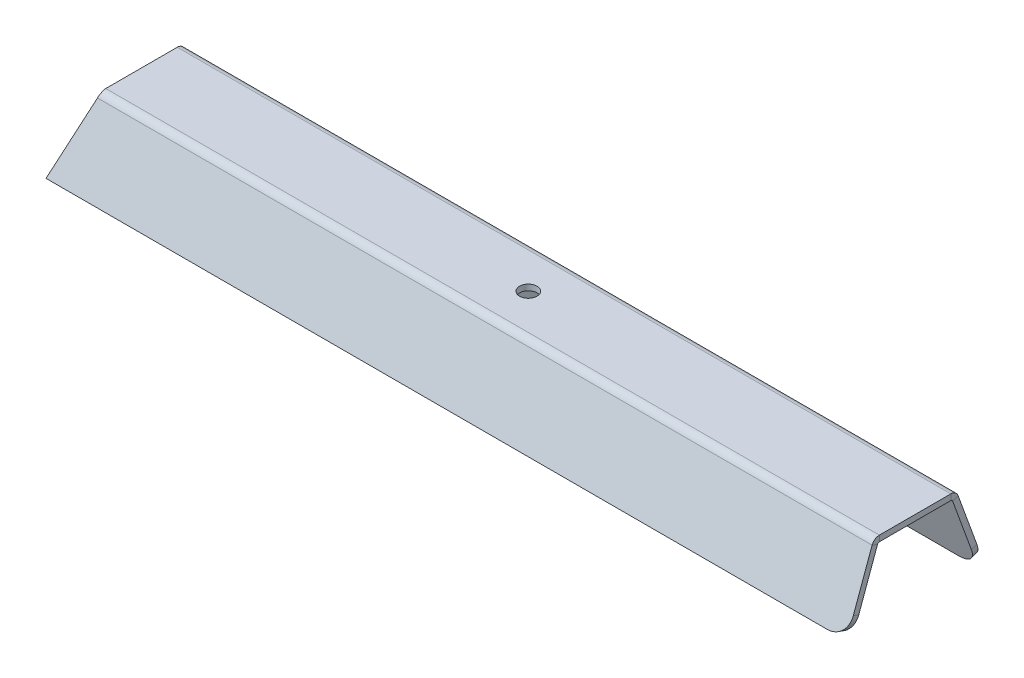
ISO-10303-21;
HEADER;
FILE_DESCRIPTION(('STEP AP214'),'2;1');
FILE_NAME('part.step','',(''),(''),'','','');
FILE_SCHEMA(('AUTOMOTIVE_DESIGN { 1 0 10303 214 1 1 1 1 }'));
ENDSEC;
DATA;
#1=APPLICATION_CONTEXT('core data for automotive mechanical design processes');
#2=APPLICATION_PROTOCOL_DEFINITION('international standard','automotive_design',2000,#1);
#3=PRODUCT_CONTEXT('',#1,'mechanical');
#4=PRODUCT('Part','Part','',(#3));
#5=PRODUCT_RELATED_PRODUCT_CATEGORY('part','',(#4));
#6=PRODUCT_DEFINITION_FORMATION('','',#4);
#7=PRODUCT_DEFINITION_CONTEXT('part definition',#1,'design');
#8=PRODUCT_DEFINITION('design','',#6,#7);
#9=PRODUCT_DEFINITION_SHAPE('','',#8);
#10=(LENGTH_UNIT() NAMED_UNIT(*) SI_UNIT(.MILLI.,.METRE.));
#11=(NAMED_UNIT(*) PLANE_ANGLE_UNIT() SI_UNIT($,.RADIAN.));
#12=(NAMED_UNIT(*) SI_UNIT($,.STERADIAN.) SOLID_ANGLE_UNIT());
#13=UNCERTAINTY_MEASURE_WITH_UNIT(LENGTH_MEASURE(1.E-05),#10,'distance_accuracy_value','');
#14=(GEOMETRIC_REPRESENTATION_CONTEXT(3) GLOBAL_UNCERTAINTY_ASSIGNED_CONTEXT((#13)) GLOBAL_UNIT_ASSIGNED_CONTEXT((#10,
#11,#12)) REPRESENTATION_CONTEXT('',''));
#15=CARTESIAN_POINT('',(0.,0.,0.));
#16=DIRECTION('',(0.,0.,1.));
#17=DIRECTION('',(1.,0.,0.));
#18=AXIS2_PLACEMENT_3D('',#15,#16,#17);
#19=CARTESIAN_POINT('',(95.,-1.5,-25.));
#20=DIRECTION('',(0.,1.,0.));
#21=DIRECTION('',(0.,0.,1.));
#22=AXIS2_PLACEMENT_3D('',#19,#20,#21);
#23=PLANE('',#22);
#24=CARTESIAN_POINT('',(0.,-1.5,0.));
#25=DIRECTION('',(0.,1.,0.));
#26=DIRECTION('',(0.,0.,1.));
#27=AXIS2_PLACEMENT_3D('',#24,#25,#26);
#28=CIRCLE('',#27,2.25);
#29=CARTESIAN_POINT('',(0.,-1.5,2.25));
#30=VERTEX_POINT('',#29);
#31=EDGE_CURVE('E499',#30,#30,#28,.T.);
#32=ORIENTED_EDGE('',*,*,#31,.T.);
#33=EDGE_LOOP('',(#32));
#34=FACE_BOUND('',#33,.T.);
#35=DIRECTION('',(0.,0.,-1.));
#36=VECTOR('',#35,1.);
#37=CARTESIAN_POINT('',(100.,-1.5,-24.9999999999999));
#38=LINE('',#37,#36);
#39=CARTESIAN_POINT('',(100.,-1.5,9.23641845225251));
#40=VERTEX_POINT('',#39);
#41=CARTESIAN_POINT('',(100.,-1.5,-9.23641845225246));
#42=VERTEX_POINT('',#41);
#43=EDGE_CURVE('E472',#40,#42,#38,.T.);
#44=ORIENTED_EDGE('',*,*,#43,.F.);
#45=DIRECTION('',(-1.,0.,0.));
#46=VECTOR('',#45,1.);
#47=CARTESIAN_POINT('',(95.,-1.5,9.23641845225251));
#48=LINE('',#47,#46);
#49=CARTESIAN_POINT('',(-100.,-1.5,9.23641845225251));
#50=VERTEX_POINT('',#49);
#51=EDGE_CURVE('E476',#40,#50,#48,.T.);
#52=ORIENTED_EDGE('',*,*,#51,.T.);
#53=DIRECTION('',(0.,0.,1.));
#54=VECTOR('',#53,1.);
#55=CARTESIAN_POINT('',(-100.,-1.5,10.));
#56=LINE('',#55,#54);
#57=CARTESIAN_POINT('',(-100.,-1.5,-9.23641845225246));
#58=VERTEX_POINT('',#57);
#59=EDGE_CURVE('E496',#58,#50,#56,.T.);
#60=ORIENTED_EDGE('',*,*,#59,.F.);
#61=DIRECTION('',(-1.,0.,0.));
#62=VECTOR('',#61,1.);
#63=CARTESIAN_POINT('',(95.,-1.5,-9.23641845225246));
#64=LINE('',#63,#62);
#65=EDGE_CURVE('E501',#42,#58,#64,.T.);
#66=ORIENTED_EDGE('',*,*,#65,.F.);
#67=EDGE_LOOP('',(#44,#52,#60,#66));
#68=FACE_BOUND('',#67,.T.);
#69=ADVANCED_FACE('F58',(#34,#68),#23,.F.);
#70=CARTESIAN_POINT('',(-100.,-1.5,10.));
#71=DIRECTION('',(-1.,0.,0.));
#72=DIRECTION('',(0.,0.,1.));
#73=AXIS2_PLACEMENT_3D('',#70,#71,#72);
#74=PLANE('',#73);
#75=DIRECTION('',(0.,-1.,0.));
#76=VECTOR('',#75,1.);
#77=CARTESIAN_POINT('',(-100.,-1.5,9.2364184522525));
#78=LINE('',#77,#76);
#79=CARTESIAN_POINT('',(-100.,0.,9.23641845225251));
#80=VERTEX_POINT('',#79);
#81=EDGE_CURVE('E12',#80,#50,#78,.T.);
#82=ORIENTED_EDGE('',*,*,#81,.F.);
#83=DIRECTION('',(0.,0.,1.));
#84=VECTOR('',#83,1.);
#85=CARTESIAN_POINT('',(-100.,0.,10.));
#86=LINE('',#85,#84);
#87=CARTESIAN_POINT('',(-100.,0.,-9.23641845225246));
#88=VERTEX_POINT('',#87);
#89=EDGE_CURVE('E77',#88,#80,#86,.T.);
#90=ORIENTED_EDGE('',*,*,#89,.F.);
#91=DIRECTION('',(0.,-1.,0.));
#92=VECTOR('',#91,1.);
#93=CARTESIAN_POINT('',(-100.,-1.5,-9.23641845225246));
#94=LINE('',#93,#92);
#95=EDGE_CURVE('E536',#88,#58,#94,.T.);
#96=ORIENTED_EDGE('',*,*,#95,.T.);
#97=ORIENTED_EDGE('',*,*,#59,.T.);
#98=EDGE_LOOP('',(#82,#90,#96,#97));
#99=FACE_BOUND('',#98,.T.);
#100=ADVANCED_FACE('F457',(#99),#74,.T.);
#101=CARTESIAN_POINT('',(100.,-1.5,-24.9999999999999));
#102=DIRECTION('',(1.,0.,0.));
#103=DIRECTION('',(0.,0.,-1.));
#104=AXIS2_PLACEMENT_3D('',#101,#102,#103);
#105=PLANE('',#104);
#106=DIRECTION('',(0.,1.,0.));
#107=VECTOR('',#106,1.);
#108=CARTESIAN_POINT('',(100.,-1.5,9.23641845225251));
#109=LINE('',#108,#107);
#110=CARTESIAN_POINT('',(100.,0.,9.23641845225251));
#111=VERTEX_POINT('',#110);
#112=EDGE_CURVE('E470',#40,#111,#109,.T.);
#113=ORIENTED_EDGE('',*,*,#112,.F.);
#114=ORIENTED_EDGE('',*,*,#43,.T.);
#115=DIRECTION('',(0.,1.,0.));
#116=VECTOR('',#115,1.);
#117=CARTESIAN_POINT('',(100.,-1.5,-9.23641845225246));
#118=LINE('',#117,#116);
#119=CARTESIAN_POINT('',(100.,0.,-9.23641845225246));
#120=VERTEX_POINT('',#119);
#121=EDGE_CURVE('E486',#42,#120,#118,.T.);
#122=ORIENTED_EDGE('',*,*,#121,.T.);
#123=DIRECTION('',(0.,0.,-1.));
#124=VECTOR('',#123,1.);
#125=CARTESIAN_POINT('',(100.,0.,-24.9999999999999));
#126=LINE('',#125,#124);
#127=EDGE_CURVE('E85',#111,#120,#126,.T.);
#128=ORIENTED_EDGE('',*,*,#127,.F.);
#129=EDGE_LOOP('',(#113,#114,#122,#128));
#130=FACE_BOUND('',#129,.T.);
#131=ADVANCED_FACE('F460',(#130),#105,.T.);
#132=CARTESIAN_POINT('',(95.,0.,-25.));
#133=DIRECTION('',(0.,1.,0.));
#134=DIRECTION('',(0.,0.,1.));
#135=AXIS2_PLACEMENT_3D('',#132,#133,#134);
#136=PLANE('',#135);
#137=DIRECTION('',(-1.,0.,0.));
#138=VECTOR('',#137,1.);
#139=CARTESIAN_POINT('',(95.,0.,9.23641845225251));
#140=LINE('',#139,#138);
#141=EDGE_CURVE('E69',#111,#80,#140,.T.);
#142=ORIENTED_EDGE('',*,*,#141,.F.);
#143=ORIENTED_EDGE('',*,*,#127,.T.);
#144=DIRECTION('',(-1.,0.,0.));
#145=VECTOR('',#144,1.);
#146=CARTESIAN_POINT('',(95.,0.,-9.23641845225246));
#147=LINE('',#146,#145);
#148=EDGE_CURVE('E488',#120,#88,#147,.T.);
#149=ORIENTED_EDGE('',*,*,#148,.T.);
#150=ORIENTED_EDGE('',*,*,#89,.T.);
#151=EDGE_LOOP('',(#142,#143,#149,#150));
#152=FACE_BOUND('',#151,.T.);
#153=CARTESIAN_POINT('',(0.,0.,0.));
#154=DIRECTION('',(0.,1.,0.));
#155=DIRECTION('',(0.,0.,1.));
#156=AXIS2_PLACEMENT_3D('',#153,#154,#155);
#157=CIRCLE('',#156,2.25);
#158=CARTESIAN_POINT('',(0.,0.,2.25));
#159=VERTEX_POINT('',#158);
#160=EDGE_CURVE('E540',#159,#159,#157,.T.);
#161=ORIENTED_EDGE('',*,*,#160,.F.);
#162=EDGE_LOOP('',(#161));
#163=FACE_BOUND('',#162,.T.);
#164=ADVANCED_FACE('F60',(#152,#163),#136,.T.);
#165=CARTESIAN_POINT('',(0.,-1.5,0.));
#166=DIRECTION('',(0.,1.,0.));
#167=DIRECTION('',(0.,0.,1.));
#168=AXIS2_PLACEMENT_3D('',#165,#166,#167);
#169=CYLINDRICAL_SURFACE('',#168,2.25);
#170=ORIENTED_EDGE('',*,*,#31,.F.);
#171=EDGE_LOOP('',(#170));
#172=FACE_BOUND('',#171,.T.);
#173=ORIENTED_EDGE('',*,*,#160,.T.);
#174=EDGE_LOOP('',(#173));
#175=FACE_BOUND('',#174,.T.);
#176=ADVANCED_FACE('F452',(#172,#175),#169,.F.);
#177=CARTESIAN_POINT('',(100.,-2.,-9.23641845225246));
#178=DIRECTION('',(-1.,0.,0.));
#179=DIRECTION('',(0.,0.,1.));
#180=AXIS2_PLACEMENT_3D('',#177,#178,#179);
#181=PLANE('',#180);
#182=DIRECTION('',(0.,0.342020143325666,-0.93969262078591));
#183=VECTOR('',#182,1.);
#184=CARTESIAN_POINT('',(100.,-1.82898992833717,-9.70626476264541));
#185=LINE('',#184,#183);
#186=CARTESIAN_POINT('',(100.,-1.82898992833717,-9.70626476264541));
#187=VERTEX_POINT('',#186);
#188=CARTESIAN_POINT('',(100.,-1.31595971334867,-11.1158036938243));
#189=VERTEX_POINT('',#188);
#190=EDGE_CURVE('E351',#187,#189,#185,.T.);
#191=ORIENTED_EDGE('',*,*,#190,.T.);
#192=CARTESIAN_POINT('',(100.,-2.,-9.23641845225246));
#193=DIRECTION('',(1.,0.,0.));
#194=DIRECTION('',(0.,0.,-1.));
#195=AXIS2_PLACEMENT_3D('',#192,#193,#194);
#196=CIRCLE('',#195,2.);
#197=EDGE_CURVE('E326',#189,#120,#196,.T.);
#198=ORIENTED_EDGE('',*,*,#197,.T.);
#199=ORIENTED_EDGE('',*,*,#121,.F.);
#200=CARTESIAN_POINT('',(100.,-2.,-9.23641845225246));
#201=DIRECTION('',(1.,0.,0.));
#202=DIRECTION('',(0.,0.,1.));
#203=AXIS2_PLACEMENT_3D('',#200,#201,#202);
#204=CIRCLE('',#203,0.500000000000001);
#205=EDGE_CURVE('E355',#187,#42,#204,.T.);
#206=ORIENTED_EDGE('',*,*,#205,.F.);
#207=EDGE_LOOP('',(#191,#198,#199,#206));
#208=FACE_BOUND('',#207,.T.);
#209=ADVANCED_FACE('F449',(#208),#181,.F.);
#210=CARTESIAN_POINT('',(-100.,-2.,-9.23641845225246));
#211=DIRECTION('',(1.,0.,0.));
#212=DIRECTION('',(0.,0.,-1.));
#213=AXIS2_PLACEMENT_3D('',#210,#211,#212);
#214=PLANE('',#213);
#215=ORIENTED_EDGE('',*,*,#95,.F.);
#216=CARTESIAN_POINT('',(-100.,-2.,-9.23641845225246));
#217=DIRECTION('',(1.,0.,0.));
#218=DIRECTION('',(0.,0.,-1.));
#219=AXIS2_PLACEMENT_3D('',#216,#217,#218);
#220=CIRCLE('',#219,2.);
#221=CARTESIAN_POINT('',(-100.,-0.361695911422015,-10.3835713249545));
#222=VERTEX_POINT('',#221);
#223=EDGE_CURVE('E396',#88,#222,#220,.F.);
#224=ORIENTED_EDGE('',*,*,#223,.T.);
#225=CARTESIAN_POINT('',(-100.,-1.5904239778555,-9.52320667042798));
#226=CARTESIAN_POINT('',(-100.,-0.361695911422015,-10.3835713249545));
#227=B_SPLINE_CURVE_WITH_KNOTS('',1,(#225,#226),.UNSPECIFIED.,.F.,.F.,(2,2),(0.,1.),.UNSPECIFIED.);
#228=CARTESIAN_POINT('',(-100.,-1.5904239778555,-9.52320667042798));
#229=VERTEX_POINT('',#228);
#230=EDGE_CURVE('E434',#222,#229,#227,.F.);
#231=ORIENTED_EDGE('',*,*,#230,.T.);
#232=CARTESIAN_POINT('',(-100.,-2.,-9.23641845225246));
#233=DIRECTION('',(-1.,0.,0.));
#234=DIRECTION('',(0.,0.,-1.));
#235=AXIS2_PLACEMENT_3D('',#232,#233,#234);
#236=CIRCLE('',#235,0.5);
#237=EDGE_CURVE('E358',#58,#229,#236,.T.);
#238=ORIENTED_EDGE('',*,*,#237,.F.);
#239=EDGE_LOOP('',(#215,#224,#231,#238));
#240=FACE_BOUND('',#239,.T.);
#241=ADVANCED_FACE('F440',(#240),#214,.F.);
#242=CARTESIAN_POINT('',(-100.,-0.361695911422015,-10.3835713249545));
#243=CARTESIAN_POINT('',(-100.089318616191,-0.595895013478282,-10.718042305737));
#244=CARTESIAN_POINT('',(-100.17793492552,-0.932270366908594,-10.976152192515));
#245=CARTESIAN_POINT('',(-100.267253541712,-1.31595971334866,-11.1158036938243));
#246=CARTESIAN_POINT('',(-100.,-1.5904239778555,-9.52320667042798));
#247=CARTESIAN_POINT('',(-100.089245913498,-1.64892609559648,-9.60675635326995));
#248=CARTESIAN_POINT('',(-100.178007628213,-1.73314566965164,-9.67138030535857));
#249=CARTESIAN_POINT('',(-100.267253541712,-1.82898992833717,-9.70626476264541));
#250=B_SPLINE_SURFACE_WITH_KNOTS('',1,3,((#242,#243,#244,#245),(#246,#247,#248,#249)),
.UNSPECIFIED.,.F.,.F.,.F.,(2,2),(4,4),(0.,1.),(0.,1.),.UNSPECIFIED.);
#251=CARTESIAN_POINT('',(-100.,-0.361695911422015,-10.3835713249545));
#252=CARTESIAN_POINT('',(-100.089318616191,-0.595895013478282,-10.718042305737));
#253=CARTESIAN_POINT('',(-100.17793492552,-0.932270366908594,-10.976152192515));
#254=CARTESIAN_POINT('',(-100.267253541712,-1.31595971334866,-11.1158036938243));
#255=B_SPLINE_CURVE_WITH_KNOTS('',3,(#251,#252,#253,#254),.UNSPECIFIED.,.F.,.F.,(4,4),(0.,1.),.UNSPECIFIED.);
#256=CARTESIAN_POINT('',(-100.267253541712,-1.31595971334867,-11.1158036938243));
#257=VERTEX_POINT('',#256);
#258=EDGE_CURVE('E359',#222,#257,#255,.T.);
#259=CARTESIAN_POINT('',(-100.267253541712,-1.31595971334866,-11.1158036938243));
#260=CARTESIAN_POINT('',(-100.267253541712,-1.82898992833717,-9.70626476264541));
#261=B_SPLINE_CURVE_WITH_KNOTS('',1,(#259,#260),.UNSPECIFIED.,.F.,.F.,(2,2),(0.,1.),.UNSPECIFIED.);
#262=CARTESIAN_POINT('',(-100.267253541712,-1.82898992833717,-9.70626476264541));
#263=VERTEX_POINT('',#262);
#264=EDGE_CURVE('E350',#257,#263,#261,.T.);
#265=CARTESIAN_POINT('',(-100.267253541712,-1.82898992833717,-9.70626476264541));
#266=CARTESIAN_POINT('',(-100.178007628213,-1.73314566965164,-9.67138030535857));
#267=CARTESIAN_POINT('',(-100.089245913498,-1.64892609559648,-9.60675635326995));
#268=CARTESIAN_POINT('',(-100.,-1.5904239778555,-9.52320667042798));
#269=B_SPLINE_CURVE_WITH_KNOTS('',3,(#265,#266,#267,#268),.UNSPECIFIED.,.F.,.F.,(4,4),(0.,1.),.UNSPECIFIED.);
#270=EDGE_CURVE('E411',#229,#263,#269,.F.);
#271=ORIENTED_EDGE('',*,*,#230,.F.);
#272=ORIENTED_EDGE('',*,*,#258,.T.);
#273=ORIENTED_EDGE('',*,*,#264,.T.);
#274=ORIENTED_EDGE('',*,*,#270,.F.);
#275=EDGE_LOOP('',(#271,#272,#273,#274));
#276=FACE_BOUND('',#275,.T.);
#277=ADVANCED_FACE('F376',(#276),#250,.F.);
#278=CARTESIAN_POINT('',(-200.27869349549,-2.,-9.23641845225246));
#279=DIRECTION('',(1.,0.,0.));
#280=DIRECTION('',(0.,0.,-1.));
#281=AXIS2_PLACEMENT_3D('',#278,#279,#280);
#282=CYLINDRICAL_SURFACE('',#281,0.5);
#283=ORIENTED_EDGE('',*,*,#270,.T.);
#284=DIRECTION('',(-1.,0.,0.));
#285=VECTOR('',#284,1.);
#286=CARTESIAN_POINT('',(95.,-1.82898992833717,-9.70626476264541));
#287=LINE('',#286,#285);
#288=EDGE_CURVE('E341',#187,#263,#287,.T.);
#289=ORIENTED_EDGE('',*,*,#288,.F.);
#290=ORIENTED_EDGE('',*,*,#205,.T.);
#291=ORIENTED_EDGE('',*,*,#65,.T.);
#292=ORIENTED_EDGE('',*,*,#237,.T.);
#293=EDGE_LOOP('',(#283,#289,#290,#291,#292));
#294=FACE_BOUND('',#293,.T.);
#295=ADVANCED_FACE('F365',(#294),#282,.F.);
#296=CARTESIAN_POINT('',(-200.27869349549,-2.,-9.23641845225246));
#297=DIRECTION('',(1.,0.,0.));
#298=DIRECTION('',(0.,0.,-1.));
#299=AXIS2_PLACEMENT_3D('',#296,#297,#298);
#300=CYLINDRICAL_SURFACE('',#299,2.);
#301=ORIENTED_EDGE('',*,*,#258,.F.);
#302=ORIENTED_EDGE('',*,*,#223,.F.);
#303=ORIENTED_EDGE('',*,*,#148,.F.);
#304=ORIENTED_EDGE('',*,*,#197,.F.);
#305=DIRECTION('',(-1.,0.,0.));
#306=VECTOR('',#305,1.);
#307=CARTESIAN_POINT('',(95.,-1.31595971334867,-11.1158036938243));
#308=LINE('',#307,#306);
#309=EDGE_CURVE('E354',#189,#257,#308,.T.);
#310=ORIENTED_EDGE('',*,*,#309,.T.);
#311=EDGE_LOOP('',(#301,#302,#303,#304,#310));
#312=FACE_BOUND('',#311,.T.);
#313=ADVANCED_FACE('F375',(#312),#300,.T.);
#314=CARTESIAN_POINT('',(95.,-15.2068472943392,-14.575406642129));
#315=DIRECTION('',(0.,0.342020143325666,-0.93969262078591));
#316=DIRECTION('',(0.,0.93969262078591,0.342020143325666));
#317=AXIS2_PLACEMENT_3D('',#314,#315,#316);
#318=CYLINDRICAL_SURFACE('',#317,5.);
#319=CARTESIAN_POINT('',(95.,-14.6938170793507,-15.9849455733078));
#320=DIRECTION('',(0.,0.342020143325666,-0.93969262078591));
#321=DIRECTION('',(0.,0.93969262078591,0.342020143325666));
#322=AXIS2_PLACEMENT_3D('',#319,#320,#321);
#323=CIRCLE('',#322,5.);
#324=CARTESIAN_POINT('',(100.,-14.6938170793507,-15.9849455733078));
#325=VERTEX_POINT('',#324);
#326=CARTESIAN_POINT('',(95.,-19.3922801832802,-17.6950462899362));
#327=VERTEX_POINT('',#326);
#328=EDGE_CURVE('E333',#325,#327,#323,.T.);
#329=ORIENTED_EDGE('',*,*,#328,.F.);
#330=DIRECTION('',(0.,0.342020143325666,-0.93969262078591));
#331=VECTOR('',#330,1.);
#332=CARTESIAN_POINT('',(100.,-15.2068472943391,-14.575406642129));
#333=LINE('',#332,#331);
#334=CARTESIAN_POINT('',(100.,-15.2068472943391,-14.575406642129));
#335=VERTEX_POINT('',#334);
#336=EDGE_CURVE('E318',#335,#325,#333,.T.);
#337=ORIENTED_EDGE('',*,*,#336,.F.);
#338=CARTESIAN_POINT('',(95.,-15.2068472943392,-14.575406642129));
#339=DIRECTION('',(0.,0.342020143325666,-0.93969262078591));
#340=DIRECTION('',(0.,0.93969262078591,0.342020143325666));
#341=AXIS2_PLACEMENT_3D('',#338,#339,#340);
#342=CIRCLE('',#341,5.);
#343=CARTESIAN_POINT('',(95.,-19.9053103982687,-16.2855073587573));
#344=VERTEX_POINT('',#343);
#345=EDGE_CURVE('E347',#335,#344,#342,.T.);
#346=ORIENTED_EDGE('',*,*,#345,.T.);
#347=DIRECTION('',(0.,0.342020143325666,-0.93969262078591));
#348=VECTOR('',#347,1.);
#349=CARTESIAN_POINT('',(95.,-19.9053103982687,-16.2855073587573));
#350=LINE('',#349,#348);
#351=EDGE_CURVE('E345',#344,#327,#350,.T.);
#352=ORIENTED_EDGE('',*,*,#351,.T.);
#353=EDGE_LOOP('',(#329,#337,#346,#352));
#354=FACE_BOUND('',#353,.T.);
#355=ADVANCED_FACE('F383',(#354),#318,.T.);
#356=CARTESIAN_POINT('',(-107.,-19.9053103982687,-16.2855073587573));
#357=DIRECTION('',(0.,-0.93969262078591,-0.342020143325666));
#358=DIRECTION('',(-1.,0.,0.));
#359=AXIS2_PLACEMENT_3D('',#356,#357,#358);
#360=PLANE('',#359);
#361=DIRECTION('',(-1.,0.,0.));
#362=VECTOR('',#361,1.);
#363=CARTESIAN_POINT('',(-107.,-19.3922801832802,-17.6950462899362));
#364=LINE('',#363,#362);
#365=CARTESIAN_POINT('',(-107.,-19.3922801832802,-17.6950462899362));
#366=VERTEX_POINT('',#365);
#367=EDGE_CURVE('E330',#327,#366,#364,.T.);
#368=ORIENTED_EDGE('',*,*,#367,.F.);
#369=ORIENTED_EDGE('',*,*,#351,.F.);
#370=DIRECTION('',(-1.,0.,0.));
#371=VECTOR('',#370,1.);
#372=CARTESIAN_POINT('',(-107.,-19.9053103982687,-16.2855073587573));
#373=LINE('',#372,#371);
#374=CARTESIAN_POINT('',(-107.,-19.9053103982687,-16.2855073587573));
#375=VERTEX_POINT('',#374);
#376=EDGE_CURVE('E342',#344,#375,#373,.T.);
#377=ORIENTED_EDGE('',*,*,#376,.T.);
#378=DIRECTION('',(0.,0.342020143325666,-0.93969262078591));
#379=VECTOR('',#378,1.);
#380=CARTESIAN_POINT('',(-107.,-19.9053103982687,-16.2855073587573));
#381=LINE('',#380,#379);
#382=EDGE_CURVE('E339',#375,#366,#381,.T.);
#383=ORIENTED_EDGE('',*,*,#382,.T.);
#384=EDGE_LOOP('',(#368,#369,#377,#383));
#385=FACE_BOUND('',#384,.T.);
#386=ADVANCED_FACE('F635',(#385),#360,.T.);
#387=CARTESIAN_POINT('',(95.,-15.2068472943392,-14.575406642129));
#388=DIRECTION('',(0.,0.342020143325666,-0.93969262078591));
#389=DIRECTION('',(0.,0.93969262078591,0.342020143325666));
#390=AXIS2_PLACEMENT_3D('',#387,#388,#389);
#391=PLANE('',#390);
#392=DIRECTION('',(0.,-0.93969262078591,-0.342020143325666));
#393=VECTOR('',#392,1.);
#394=CARTESIAN_POINT('',(100.,-15.2068472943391,-14.575406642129));
#395=LINE('',#394,#393);
#396=EDGE_CURVE('E327',#187,#335,#395,.T.);
#397=ORIENTED_EDGE('',*,*,#396,.F.);
#398=ORIENTED_EDGE('',*,*,#288,.T.);
#399=DIRECTION('',(0.330350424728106,0.886936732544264,0.322818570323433));
#400=VECTOR('',#399,1.);
#401=CARTESIAN_POINT('',(-100.,-1.11145798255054,-9.44510449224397));
#402=LINE('',#401,#400);
#403=EDGE_CURVE('E338',#375,#263,#402,.T.);
#404=ORIENTED_EDGE('',*,*,#403,.F.);
#405=ORIENTED_EDGE('',*,*,#376,.F.);
#406=ORIENTED_EDGE('',*,*,#345,.F.);
#407=EDGE_LOOP('',(#397,#398,#404,#405,#406));
#408=FACE_BOUND('',#407,.T.);
#409=ADVANCED_FACE('F570',(#408),#391,.F.);
#410=CARTESIAN_POINT('',(-100.,-1.11145798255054,-9.44510449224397));
#411=DIRECTION('',(-0.943858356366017,0.310427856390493,0.112986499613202));
#412=DIRECTION('',(0.330350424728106,0.886936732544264,0.322818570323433));
#413=AXIS2_PLACEMENT_3D('',#410,#411,#412);
#414=PLANE('',#413);
#415=ORIENTED_EDGE('',*,*,#264,.F.);
#416=DIRECTION('',(0.330350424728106,0.886936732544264,0.322818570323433));
#417=VECTOR('',#416,1.);
#418=CARTESIAN_POINT('',(-100.,-0.598427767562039,-10.8546434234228));
#419=LINE('',#418,#417);
#420=EDGE_CURVE('E329',#366,#257,#419,.T.);
#421=ORIENTED_EDGE('',*,*,#420,.F.);
#422=ORIENTED_EDGE('',*,*,#382,.F.);
#423=ORIENTED_EDGE('',*,*,#403,.T.);
#424=EDGE_LOOP('',(#415,#421,#422,#423));
#425=FACE_BOUND('',#424,.T.);
#426=ADVANCED_FACE('F560',(#425),#414,.T.);
#427=CARTESIAN_POINT('',(95.,-14.6938170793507,-15.9849455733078));
#428=DIRECTION('',(0.,0.342020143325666,-0.93969262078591));
#429=DIRECTION('',(0.,0.93969262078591,0.342020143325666));
#430=AXIS2_PLACEMENT_3D('',#427,#428,#429);
#431=PLANE('',#430);
#432=ORIENTED_EDGE('',*,*,#309,.F.);
#433=DIRECTION('',(0.,-0.93969262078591,-0.342020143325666));
#434=VECTOR('',#433,1.);
#435=CARTESIAN_POINT('',(100.,-14.6938170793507,-15.9849455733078));
#436=LINE('',#435,#434);
#437=EDGE_CURVE('E336',#189,#325,#436,.T.);
#438=ORIENTED_EDGE('',*,*,#437,.T.);
#439=ORIENTED_EDGE('',*,*,#328,.T.);
#440=ORIENTED_EDGE('',*,*,#367,.T.);
#441=ORIENTED_EDGE('',*,*,#420,.T.);
#442=EDGE_LOOP('',(#432,#438,#439,#440,#441));
#443=FACE_BOUND('',#442,.T.);
#444=ADVANCED_FACE('F569',(#443),#431,.T.);
#445=CARTESIAN_POINT('',(100.,-15.2068472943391,-14.575406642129));
#446=DIRECTION('',(1.,0.,0.));
#447=DIRECTION('',(0.,-0.93969262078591,-0.342020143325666));
#448=AXIS2_PLACEMENT_3D('',#445,#446,#447);
#449=PLANE('',#448);
#450=ORIENTED_EDGE('',*,*,#190,.F.);
#451=ORIENTED_EDGE('',*,*,#396,.T.);
#452=ORIENTED_EDGE('',*,*,#336,.T.);
#453=ORIENTED_EDGE('',*,*,#437,.F.);
#454=EDGE_LOOP('',(#450,#451,#452,#453));
#455=FACE_BOUND('',#454,.T.);
#456=ADVANCED_FACE('F378',(#455),#449,.T.);
#457=CARTESIAN_POINT('',(100.,-2.,9.23641845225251));
#458=DIRECTION('',(-1.,0.,0.));
#459=DIRECTION('',(0.,0.,1.));
#460=AXIS2_PLACEMENT_3D('',#457,#458,#459);
#461=PLANE('',#460);
#462=ORIENTED_EDGE('',*,*,#112,.T.);
#463=CARTESIAN_POINT('',(100.,-2.,9.23641845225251));
#464=DIRECTION('',(-1.,0.,0.));
#465=DIRECTION('',(0.,0.,1.));
#466=AXIS2_PLACEMENT_3D('',#463,#464,#465);
#467=CIRCLE('',#466,2.);
#468=CARTESIAN_POINT('',(100.,-1.31595971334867,11.1158036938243));
#469=VERTEX_POINT('',#468);
#470=EDGE_CURVE('E195',#111,#469,#467,.F.);
#471=ORIENTED_EDGE('',*,*,#470,.T.);
#472=DIRECTION('',(0.,0.342020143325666,0.93969262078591));
#473=VECTOR('',#472,1.);
#474=CARTESIAN_POINT('',(100.,-1.82898992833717,9.70626476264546));
#475=LINE('',#474,#473);
#476=CARTESIAN_POINT('',(100.,-1.82898992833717,9.70626476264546));
#477=VERTEX_POINT('',#476);
#478=EDGE_CURVE('E481',#477,#469,#475,.T.);
#479=ORIENTED_EDGE('',*,*,#478,.F.);
#480=CARTESIAN_POINT('',(100.,-2.,9.23641845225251));
#481=DIRECTION('',(1.,0.,0.));
#482=DIRECTION('',(0.,0.,1.));
#483=AXIS2_PLACEMENT_3D('',#480,#481,#482);
#484=CIRCLE('',#483,0.5);
#485=EDGE_CURVE('E209',#40,#477,#484,.T.);
#486=ORIENTED_EDGE('',*,*,#485,.F.);
#487=EDGE_LOOP('',(#462,#471,#479,#486));
#488=FACE_BOUND('',#487,.T.);
#489=ADVANCED_FACE('F279',(#488),#461,.F.);
#490=CARTESIAN_POINT('',(-100.267253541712,-1.31595971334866,11.1158036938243));
#491=CARTESIAN_POINT('',(-100.17793492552,-0.93227036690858,10.9761521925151));
#492=CARTESIAN_POINT('',(-100.089318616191,-0.595895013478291,10.7180423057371));
#493=CARTESIAN_POINT('',(-100.,-0.361695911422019,10.3835713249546));
#494=CARTESIAN_POINT('',(-100.267253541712,-1.82898992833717,9.70626476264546));
#495=CARTESIAN_POINT('',(-100.178007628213,-1.73314566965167,9.67138030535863));
#496=CARTESIAN_POINT('',(-100.089245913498,-1.64892609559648,9.60675635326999));
#497=CARTESIAN_POINT('',(-100.,-1.5904239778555,9.52320667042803));
#498=B_SPLINE_SURFACE_WITH_KNOTS('',1,3,((#490,#491,#492,#493),(#494,#495,#496,#497)),
.UNSPECIFIED.,.F.,.F.,.F.,(2,2),(4,4),(0.,1.),(0.,1.),.UNSPECIFIED.);
#499=CARTESIAN_POINT('',(-100.267253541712,-1.82898992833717,9.70626476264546));
#500=CARTESIAN_POINT('',(-100.267253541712,-1.31595971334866,11.1158036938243));
#501=B_SPLINE_CURVE_WITH_KNOTS('',1,(#499,#500),.UNSPECIFIED.,.F.,.F.,(2,2),(0.,1.),.UNSPECIFIED.);
#502=CARTESIAN_POINT('',(-100.267253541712,-1.31595971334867,11.1158036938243));
#503=VERTEX_POINT('',#502);
#504=CARTESIAN_POINT('',(-100.267253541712,-1.82898992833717,9.70626476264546));
#505=VERTEX_POINT('',#504);
#506=EDGE_CURVE('E184',#503,#505,#501,.F.);
#507=CARTESIAN_POINT('',(-100.267253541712,-1.31595971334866,11.1158036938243));
#508=CARTESIAN_POINT('',(-100.17793492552,-0.93227036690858,10.9761521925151));
#509=CARTESIAN_POINT('',(-100.089318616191,-0.595895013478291,10.7180423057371));
#510=CARTESIAN_POINT('',(-100.,-0.361695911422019,10.3835713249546));
#511=B_SPLINE_CURVE_WITH_KNOTS('',3,(#507,#508,#509,#510),.UNSPECIFIED.,.F.,.F.,(4,4),(0.,1.),.UNSPECIFIED.);
#512=CARTESIAN_POINT('',(-100.,-0.361695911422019,10.3835713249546));
#513=VERTEX_POINT('',#512);
#514=EDGE_CURVE('E216',#503,#513,#511,.T.);
#515=CARTESIAN_POINT('',(-100.,-0.361695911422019,10.3835713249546));
#516=CARTESIAN_POINT('',(-100.,-1.5904239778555,9.52320667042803));
#517=B_SPLINE_CURVE_WITH_KNOTS('',1,(#515,#516),.UNSPECIFIED.,.F.,.F.,(2,2),(0.,1.),.UNSPECIFIED.);
#518=CARTESIAN_POINT('',(-100.,-1.5904239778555,9.52320667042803));
#519=VERTEX_POINT('',#518);
#520=EDGE_CURVE('E305',#513,#519,#517,.T.);
#521=CARTESIAN_POINT('',(-100.,-1.5904239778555,9.52320667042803));
#522=CARTESIAN_POINT('',(-100.089245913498,-1.64892609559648,9.60675635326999));
#523=CARTESIAN_POINT('',(-100.178007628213,-1.73314566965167,9.67138030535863));
#524=CARTESIAN_POINT('',(-100.267253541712,-1.82898992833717,9.70626476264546));
#525=B_SPLINE_CURVE_WITH_KNOTS('',3,(#521,#522,#523,#524),.UNSPECIFIED.,.F.,.F.,(4,4),(0.,1.),.UNSPECIFIED.);
#526=EDGE_CURVE('E212',#505,#519,#525,.F.);
#527=ORIENTED_EDGE('',*,*,#506,.F.);
#528=ORIENTED_EDGE('',*,*,#514,.T.);
#529=ORIENTED_EDGE('',*,*,#520,.T.);
#530=ORIENTED_EDGE('',*,*,#526,.F.);
#531=EDGE_LOOP('',(#527,#528,#529,#530));
#532=FACE_BOUND('',#531,.T.);
#533=ADVANCED_FACE('F268',(#532),#498,.F.);
#534=CARTESIAN_POINT('',(-100.,-2.,9.23641845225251));
#535=DIRECTION('',(1.,0.,0.));
#536=DIRECTION('',(0.,0.,-1.));
#537=AXIS2_PLACEMENT_3D('',#534,#535,#536);
#538=PLANE('',#537);
#539=ORIENTED_EDGE('',*,*,#520,.F.);
#540=CARTESIAN_POINT('',(-100.,-2.,9.23641845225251));
#541=DIRECTION('',(-1.,0.,0.));
#542=DIRECTION('',(0.,0.,1.));
#543=AXIS2_PLACEMENT_3D('',#540,#541,#542);
#544=CIRCLE('',#543,2.);
#545=EDGE_CURVE('E213',#513,#80,#544,.T.);
#546=ORIENTED_EDGE('',*,*,#545,.T.);
#547=ORIENTED_EDGE('',*,*,#81,.T.);
#548=CARTESIAN_POINT('',(-100.,-2.,9.23641845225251));
#549=DIRECTION('',(-1.,0.,0.));
#550=DIRECTION('',(0.,0.,-1.));
#551=AXIS2_PLACEMENT_3D('',#548,#549,#550);
#552=CIRCLE('',#551,0.5);
#553=EDGE_CURVE('E225',#519,#50,#552,.T.);
#554=ORIENTED_EDGE('',*,*,#553,.F.);
#555=EDGE_LOOP('',(#539,#546,#547,#554));
#556=FACE_BOUND('',#555,.T.);
#557=ADVANCED_FACE('F238',(#556),#538,.F.);
#558=CARTESIAN_POINT('',(200.27869349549,-2.,9.23641845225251));
#559=DIRECTION('',(-1.,0.,0.));
#560=DIRECTION('',(0.,0.,1.));
#561=AXIS2_PLACEMENT_3D('',#558,#559,#560);
#562=CYLINDRICAL_SURFACE('',#561,0.5);
#563=ORIENTED_EDGE('',*,*,#553,.T.);
#564=ORIENTED_EDGE('',*,*,#51,.F.);
#565=ORIENTED_EDGE('',*,*,#485,.T.);
#566=DIRECTION('',(-1.,0.,0.));
#567=VECTOR('',#566,1.);
#568=CARTESIAN_POINT('',(95.,-1.82898992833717,9.70626476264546));
#569=LINE('',#568,#567);
#570=EDGE_CURVE('E203',#477,#505,#569,.T.);
#571=ORIENTED_EDGE('',*,*,#570,.T.);
#572=ORIENTED_EDGE('',*,*,#526,.T.);
#573=EDGE_LOOP('',(#563,#564,#565,#571,#572));
#574=FACE_BOUND('',#573,.T.);
#575=ADVANCED_FACE('F228',(#574),#562,.F.);
#576=CARTESIAN_POINT('',(200.27869349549,-2.,9.23641845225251));
#577=DIRECTION('',(-1.,0.,0.));
#578=DIRECTION('',(0.,0.,1.));
#579=AXIS2_PLACEMENT_3D('',#576,#577,#578);
#580=CYLINDRICAL_SURFACE('',#579,2.);
#581=ORIENTED_EDGE('',*,*,#545,.F.);
#582=ORIENTED_EDGE('',*,*,#514,.F.);
#583=DIRECTION('',(-1.,0.,0.));
#584=VECTOR('',#583,1.);
#585=CARTESIAN_POINT('',(95.,-1.31595971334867,11.1158036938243));
#586=LINE('',#585,#584);
#587=EDGE_CURVE('E509',#469,#503,#586,.T.);
#588=ORIENTED_EDGE('',*,*,#587,.F.);
#589=ORIENTED_EDGE('',*,*,#470,.F.);
#590=ORIENTED_EDGE('',*,*,#141,.T.);
#591=EDGE_LOOP('',(#581,#582,#588,#589,#590));
#592=FACE_BOUND('',#591,.T.);
#593=ADVANCED_FACE('F237',(#592),#580,.T.);
#594=CARTESIAN_POINT('',(-107.,-19.9053103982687,16.2855073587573));
#595=DIRECTION('',(0.,-0.93969262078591,0.342020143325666));
#596=DIRECTION('',(1.,0.,0.));
#597=AXIS2_PLACEMENT_3D('',#594,#595,#596);
#598=PLANE('',#597);
#599=DIRECTION('',(1.,0.,0.));
#600=VECTOR('',#599,1.);
#601=CARTESIAN_POINT('',(-107.,-19.3922801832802,17.6950462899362));
#602=LINE('',#601,#600);
#603=CARTESIAN_POINT('',(-107.,-19.3922801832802,17.6950462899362));
#604=VERTEX_POINT('',#603);
#605=CARTESIAN_POINT('',(95.,-19.3922801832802,17.6950462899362));
#606=VERTEX_POINT('',#605);
#607=EDGE_CURVE('E194',#604,#606,#602,.T.);
#608=ORIENTED_EDGE('',*,*,#607,.F.);
#609=DIRECTION('',(0.,0.342020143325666,0.93969262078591));
#610=VECTOR('',#609,1.);
#611=CARTESIAN_POINT('',(-107.,-19.9053103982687,16.2855073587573));
#612=LINE('',#611,#610);
#613=CARTESIAN_POINT('',(-107.,-19.9053103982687,16.2855073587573));
#614=VERTEX_POINT('',#613);
#615=EDGE_CURVE('E181',#614,#604,#612,.T.);
#616=ORIENTED_EDGE('',*,*,#615,.F.);
#617=DIRECTION('',(1.,0.,0.));
#618=VECTOR('',#617,1.);
#619=CARTESIAN_POINT('',(-107.,-19.9053103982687,16.2855073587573));
#620=LINE('',#619,#618);
#621=CARTESIAN_POINT('',(95.,-19.9053103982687,16.2855073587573));
#622=VERTEX_POINT('',#621);
#623=EDGE_CURVE('E192',#614,#622,#620,.T.);
#624=ORIENTED_EDGE('',*,*,#623,.T.);
#625=DIRECTION('',(0.,0.342020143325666,0.93969262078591));
#626=VECTOR('',#625,1.);
#627=CARTESIAN_POINT('',(95.,-19.9053103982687,16.2855073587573));
#628=LINE('',#627,#626);
#629=EDGE_CURVE('E202',#622,#606,#628,.T.);
#630=ORIENTED_EDGE('',*,*,#629,.T.);
#631=EDGE_LOOP('',(#608,#616,#624,#630));
#632=FACE_BOUND('',#631,.T.);
#633=ADVANCED_FACE('F191',(#632),#598,.T.);
#634=CARTESIAN_POINT('',(95.,-15.2068472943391,14.575406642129));
#635=DIRECTION('',(0.,0.342020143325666,0.93969262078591));
#636=DIRECTION('',(0.,-0.93969262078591,0.342020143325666));
#637=AXIS2_PLACEMENT_3D('',#634,#635,#636);
#638=CYLINDRICAL_SURFACE('',#637,5.);
#639=CARTESIAN_POINT('',(95.,-14.6938170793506,15.9849455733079));
#640=DIRECTION('',(0.,0.342020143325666,0.93969262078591));
#641=DIRECTION('',(0.,0.93969262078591,-0.342020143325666));
#642=AXIS2_PLACEMENT_3D('',#639,#640,#641);
#643=CIRCLE('',#642,5.);
#644=CARTESIAN_POINT('',(100.,-14.6938170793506,15.9849455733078));
#645=VERTEX_POINT('',#644);
#646=EDGE_CURVE('E853',#606,#645,#643,.T.);
#647=ORIENTED_EDGE('',*,*,#646,.F.);
#648=ORIENTED_EDGE('',*,*,#629,.F.);
#649=CARTESIAN_POINT('',(95.,-15.2068472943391,14.575406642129));
#650=DIRECTION('',(0.,0.342020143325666,0.93969262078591));
#651=DIRECTION('',(0.,0.93969262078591,-0.342020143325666));
#652=AXIS2_PLACEMENT_3D('',#649,#650,#651);
#653=CIRCLE('',#652,5.);
#654=CARTESIAN_POINT('',(100.,-15.2068472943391,14.575406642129));
#655=VERTEX_POINT('',#654);
#656=EDGE_CURVE('E201',#622,#655,#653,.T.);
#657=ORIENTED_EDGE('',*,*,#656,.T.);
#658=DIRECTION('',(0.,0.342020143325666,0.93969262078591));
#659=VECTOR('',#658,1.);
#660=CARTESIAN_POINT('',(100.,-15.2068472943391,14.575406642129));
#661=LINE('',#660,#659);
#662=EDGE_CURVE('E528',#655,#645,#661,.T.);
#663=ORIENTED_EDGE('',*,*,#662,.T.);
#664=EDGE_LOOP('',(#647,#648,#657,#663));
#665=FACE_BOUND('',#664,.T.);
#666=ADVANCED_FACE('F531',(#665),#638,.T.);
#667=CARTESIAN_POINT('',(95.,31.7777837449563,-2.5256005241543));
#668=DIRECTION('',(0.,0.342020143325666,0.93969262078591));
#669=DIRECTION('',(0.,-0.93969262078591,0.342020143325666));
#670=AXIS2_PLACEMENT_3D('',#667,#668,#669);
#671=PLANE('',#670);
#672=ORIENTED_EDGE('',*,*,#570,.F.);
#673=DIRECTION('',(0.,0.93969262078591,-0.342020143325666));
#674=VECTOR('',#673,1.);
#675=CARTESIAN_POINT('',(100.,31.7777837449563,-2.52560052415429));
#676=LINE('',#675,#674);
#677=EDGE_CURVE('E521',#655,#477,#676,.T.);
#678=ORIENTED_EDGE('',*,*,#677,.F.);
#679=ORIENTED_EDGE('',*,*,#656,.F.);
#680=ORIENTED_EDGE('',*,*,#623,.F.);
#681=DIRECTION('',(-0.330350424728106,-0.886936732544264,0.322818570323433));
#682=VECTOR('',#681,1.);
#683=CARTESIAN_POINT('',(-100.,-1.11145798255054,9.44510449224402));
#684=LINE('',#683,#682);
#685=EDGE_CURVE('E178',#505,#614,#684,.T.);
#686=ORIENTED_EDGE('',*,*,#685,.F.);
#687=EDGE_LOOP('',(#672,#678,#679,#680,#686));
#688=FACE_BOUND('',#687,.T.);
#689=ADVANCED_FACE('F198',(#688),#671,.F.);
#690=CARTESIAN_POINT('',(100.,31.7777837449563,-2.52560052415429));
#691=DIRECTION('',(1.,0.,0.));
#692=DIRECTION('',(0.,0.93969262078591,-0.342020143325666));
#693=AXIS2_PLACEMENT_3D('',#690,#691,#692);
#694=PLANE('',#693);
#695=ORIENTED_EDGE('',*,*,#677,.T.);
#696=ORIENTED_EDGE('',*,*,#478,.T.);
#697=DIRECTION('',(0.,0.93969262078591,-0.342020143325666));
#698=VECTOR('',#697,1.);
#699=CARTESIAN_POINT('',(100.,32.2908139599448,-1.11606159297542));
#700=LINE('',#699,#698);
#701=EDGE_CURVE('E514',#645,#469,#700,.T.);
#702=ORIENTED_EDGE('',*,*,#701,.F.);
#703=ORIENTED_EDGE('',*,*,#662,.F.);
#704=EDGE_LOOP('',(#695,#696,#702,#703));
#705=FACE_BOUND('',#704,.T.);
#706=ADVANCED_FACE('F533',(#705),#694,.T.);
#707=CARTESIAN_POINT('',(95.,32.2908139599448,-1.11606159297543));
#708=DIRECTION('',(0.,0.342020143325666,0.93969262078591));
#709=DIRECTION('',(0.,-0.93969262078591,0.342020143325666));
#710=AXIS2_PLACEMENT_3D('',#707,#708,#709);
#711=PLANE('',#710);
#712=ORIENTED_EDGE('',*,*,#701,.T.);
#713=ORIENTED_EDGE('',*,*,#587,.T.);
#714=DIRECTION('',(-0.330350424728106,-0.886936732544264,0.322818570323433));
#715=VECTOR('',#714,1.);
#716=CARTESIAN_POINT('',(-100.,-0.598427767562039,10.8546434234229));
#717=LINE('',#716,#715);
#718=EDGE_CURVE('E507',#503,#604,#717,.T.);
#719=ORIENTED_EDGE('',*,*,#718,.T.);
#720=ORIENTED_EDGE('',*,*,#607,.T.);
#721=ORIENTED_EDGE('',*,*,#646,.T.);
#722=EDGE_LOOP('',(#712,#713,#719,#720,#721));
#723=FACE_BOUND('',#722,.T.);
#724=ADVANCED_FACE('F738',(#723),#711,.T.);
#725=CARTESIAN_POINT('',(-100.,-1.11145798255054,9.44510449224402));
#726=DIRECTION('',(-0.943858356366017,0.310427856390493,-0.112986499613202));
#727=DIRECTION('',(-0.330350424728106,-0.886936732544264,0.322818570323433));
#728=AXIS2_PLACEMENT_3D('',#725,#726,#727);
#729=PLANE('',#728);
#730=ORIENTED_EDGE('',*,*,#718,.F.);
#731=ORIENTED_EDGE('',*,*,#506,.T.);
#732=ORIENTED_EDGE('',*,*,#685,.T.);
#733=ORIENTED_EDGE('',*,*,#615,.T.);
#734=EDGE_LOOP('',(#730,#731,#732,#733));
#735=FACE_BOUND('',#734,.T.);
#736=ADVANCED_FACE('F180',(#735),#729,.T.);
#737=CLOSED_SHELL('',(#69,#100,#131,#164,#176,#209,#241,#277,#295,#313,#355,#386,#409,#426,#444,
#456,#489,#533,#557,#575,#593,#633,#666,#689,#706,#724,#736));
#738=MANIFOLD_SOLID_BREP('B2',#737);
#739=ADVANCED_BREP_SHAPE_REPRESENTATION('',(#18,#738),#14);
#740=SHAPE_DEFINITION_REPRESENTATION(#9,#739);
ENDSEC;
END-ISO-10303-21;
